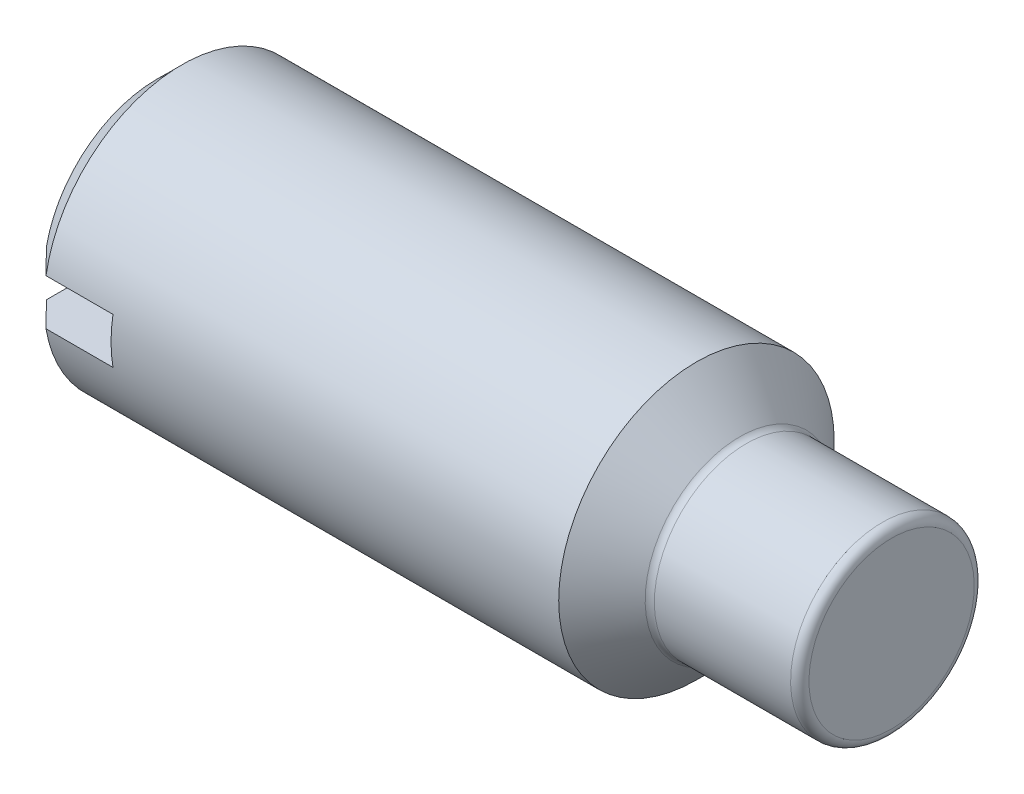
ISO-10303-21;
HEADER;
FILE_DESCRIPTION(('STEP AP214'),'2;1');
FILE_NAME('part.step','',(''),(''),'','','');
FILE_SCHEMA(('AUTOMOTIVE_DESIGN { 1 0 10303 214 1 1 1 1 }'));
ENDSEC;
DATA;
#1=APPLICATION_CONTEXT('core data for automotive mechanical design processes');
#2=APPLICATION_PROTOCOL_DEFINITION('international standard','automotive_design',2000,#1);
#3=PRODUCT_CONTEXT('',#1,'mechanical');
#4=PRODUCT('Part','Part','',(#3));
#5=PRODUCT_RELATED_PRODUCT_CATEGORY('part','',(#4));
#6=PRODUCT_DEFINITION_FORMATION('','',#4);
#7=PRODUCT_DEFINITION_CONTEXT('part definition',#1,'design');
#8=PRODUCT_DEFINITION('design','',#6,#7);
#9=PRODUCT_DEFINITION_SHAPE('','',#8);
#10=(LENGTH_UNIT() NAMED_UNIT(*) SI_UNIT(.MILLI.,.METRE.));
#11=(NAMED_UNIT(*) PLANE_ANGLE_UNIT() SI_UNIT($,.RADIAN.));
#12=(NAMED_UNIT(*) SI_UNIT($,.STERADIAN.) SOLID_ANGLE_UNIT());
#13=UNCERTAINTY_MEASURE_WITH_UNIT(LENGTH_MEASURE(1.E-05),#10,'distance_accuracy_value','');
#14=(GEOMETRIC_REPRESENTATION_CONTEXT(3) GLOBAL_UNCERTAINTY_ASSIGNED_CONTEXT((#13)) GLOBAL_UNIT_ASSIGNED_CONTEXT((#10,
#11,#12)) REPRESENTATION_CONTEXT('',''));
#15=CARTESIAN_POINT('',(0.,0.,0.));
#16=DIRECTION('',(0.,0.,1.));
#17=DIRECTION('',(1.,0.,0.));
#18=AXIS2_PLACEMENT_3D('',#15,#16,#17);
#19=CARTESIAN_POINT('',(0.,3.,0.));
#20=DIRECTION('',(1.,0.,0.));
#21=DIRECTION('',(0.,1.,0.));
#22=AXIS2_PLACEMENT_3D('',#19,#20,#21);
#23=PLANE('',#22);
#24=DIRECTION('',(0.,0.,1.));
#25=VECTOR('',#24,1.);
#26=CARTESIAN_POINT('',(0.,0.5,0.));
#27=LINE('',#26,#25);
#28=CARTESIAN_POINT('',(0.,0.5,-2.40711907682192));
#29=VERTEX_POINT('',#28);
#30=CARTESIAN_POINT('',(0.,0.5,2.40711907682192));
#31=VERTEX_POINT('',#30);
#32=EDGE_CURVE('E124',#29,#31,#27,.T.);
#33=ORIENTED_EDGE('',*,*,#32,.T.);
#34=CARTESIAN_POINT('',(0.,0.,0.));
#35=DIRECTION('',(1.,0.,0.));
#36=DIRECTION('',(0.,1.,0.));
#37=AXIS2_PLACEMENT_3D('',#34,#35,#36);
#38=CIRCLE('',#37,2.4585);
#39=EDGE_CURVE('E138',#31,#29,#38,.F.);
#40=ORIENTED_EDGE('',*,*,#39,.T.);
#41=EDGE_LOOP('',(#33,#40));
#42=FACE_BOUND('',#41,.T.);
#43=ADVANCED_FACE('F30',(#42),#23,.F.);
#44=CARTESIAN_POINT('',(16.,0.,0.));
#45=DIRECTION('',(-1.,0.,0.));
#46=DIRECTION('',(0.,-1.,0.));
#47=AXIS2_PLACEMENT_3D('',#44,#45,#46);
#48=PLANE('',#47);
#49=CARTESIAN_POINT('',(16.,0.,0.));
#50=DIRECTION('',(-1.,0.,0.));
#51=DIRECTION('',(0.,-1.,0.));
#52=AXIS2_PLACEMENT_3D('',#49,#50,#51);
#53=CIRCLE('',#52,1.8);
#54=CARTESIAN_POINT('',(16.,-1.8,0.));
#55=VERTEX_POINT('',#54);
#56=EDGE_CURVE('E132',#55,#55,#53,.F.);
#57=ORIENTED_EDGE('',*,*,#56,.T.);
#58=EDGE_LOOP('',(#57));
#59=FACE_BOUND('',#58,.T.);
#60=ADVANCED_FACE('F184',(#59),#48,.F.);
#61=CARTESIAN_POINT('',(-8.57033571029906,0.,0.));
#62=DIRECTION('',(-1.,0.,0.));
#63=DIRECTION('',(0.,-1.,0.));
#64=AXIS2_PLACEMENT_3D('',#61,#62,#63);
#65=CYLINDRICAL_SURFACE('',#64,2.);
#66=CARTESIAN_POINT('',(15.8,0.,0.));
#67=DIRECTION('',(-1.,0.,0.));
#68=DIRECTION('',(0.,-1.,0.));
#69=AXIS2_PLACEMENT_3D('',#66,#67,#68);
#70=CIRCLE('',#69,2.);
#71=CARTESIAN_POINT('',(15.8,-2.,0.));
#72=VERTEX_POINT('',#71);
#73=EDGE_CURVE('E129',#72,#72,#70,.T.);
#74=ORIENTED_EDGE('',*,*,#73,.T.);
#75=EDGE_LOOP('',(#74));
#76=FACE_BOUND('',#75,.T.);
#77=CARTESIAN_POINT('',(12.8328427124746,0.,0.));
#78=DIRECTION('',(-1.,0.,0.));
#79=DIRECTION('',(0.,-1.,0.));
#80=AXIS2_PLACEMENT_3D('',#77,#78,#79);
#81=CIRCLE('',#80,2.);
#82=CARTESIAN_POINT('',(12.8328427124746,-2.,0.));
#83=VERTEX_POINT('',#82);
#84=EDGE_CURVE('E107',#83,#83,#81,.F.);
#85=ORIENTED_EDGE('',*,*,#84,.T.);
#86=EDGE_LOOP('',(#85));
#87=FACE_BOUND('',#86,.T.);
#88=ADVANCED_FACE('F188',(#76,#87),#65,.T.);
#89=CARTESIAN_POINT('',(12.75,0.,0.));
#90=DIRECTION('',(-1.,0.,0.));
#91=DIRECTION('',(0.,-1.,0.));
#92=AXIS2_PLACEMENT_3D('',#89,#90,#91);
#93=CONICAL_SURFACE('',#92,2.,0.78539816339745);
#94=CARTESIAN_POINT('',(12.6914213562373,0.,0.));
#95=DIRECTION('',(-1.,0.,0.));
#96=DIRECTION('',(0.,-1.,0.));
#97=AXIS2_PLACEMENT_3D('',#94,#95,#96);
#98=CIRCLE('',#97,2.05857864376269);
#99=CARTESIAN_POINT('',(12.6914213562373,-2.05857864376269,0.));
#100=VERTEX_POINT('',#99);
#101=EDGE_CURVE('E135',#100,#100,#98,.T.);
#102=ORIENTED_EDGE('',*,*,#101,.T.);
#103=EDGE_LOOP('',(#102));
#104=FACE_BOUND('',#103,.T.);
#105=CARTESIAN_POINT('',(11.75,0.,0.));
#106=DIRECTION('',(-1.,0.,0.));
#107=DIRECTION('',(0.,-1.,0.));
#108=AXIS2_PLACEMENT_3D('',#105,#106,#107);
#109=CIRCLE('',#108,3.);
#110=CARTESIAN_POINT('',(11.75,-3.,0.));
#111=VERTEX_POINT('',#110);
#112=EDGE_CURVE('E119',#111,#111,#109,.T.);
#113=ORIENTED_EDGE('',*,*,#112,.F.);
#114=EDGE_LOOP('',(#113));
#115=FACE_BOUND('',#114,.T.);
#116=ADVANCED_FACE('F196',(#104,#115),#93,.T.);
#117=CARTESIAN_POINT('',(-8.57033571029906,0.,0.));
#118=DIRECTION('',(-1.,0.,0.));
#119=DIRECTION('',(0.,-1.,0.));
#120=AXIS2_PLACEMENT_3D('',#117,#118,#119);
#121=CYLINDRICAL_SURFACE('',#120,3.);
#122=DIRECTION('',(-1.,0.,0.));
#123=VECTOR('',#122,1.);
#124=CARTESIAN_POINT('',(-8.57033571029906,0.5,-2.95803989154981));
#125=LINE('',#124,#123);
#126=CARTESIAN_POINT('',(2.,0.5,-2.95803989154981));
#127=VERTEX_POINT('',#126);
#128=CARTESIAN_POINT('',(0.541499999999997,0.5,-2.95803989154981));
#129=VERTEX_POINT('',#128);
#130=EDGE_CURVE('E117',#127,#129,#125,.T.);
#131=ORIENTED_EDGE('',*,*,#130,.T.);
#132=CARTESIAN_POINT('',(0.541499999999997,0.,0.));
#133=DIRECTION('',(1.,0.,0.));
#134=DIRECTION('',(0.,1.,0.));
#135=AXIS2_PLACEMENT_3D('',#132,#133,#134);
#136=CIRCLE('',#135,3.);
#137=CARTESIAN_POINT('',(0.541499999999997,0.5,2.95803989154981));
#138=VERTEX_POINT('',#137);
#139=EDGE_CURVE('E175',#129,#138,#136,.T.);
#140=ORIENTED_EDGE('',*,*,#139,.T.);
#141=DIRECTION('',(-1.,0.,0.));
#142=VECTOR('',#141,1.);
#143=CARTESIAN_POINT('',(-8.57033571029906,0.5,2.95803989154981));
#144=LINE('',#143,#142);
#145=CARTESIAN_POINT('',(2.,0.5,2.95803989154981));
#146=VERTEX_POINT('',#145);
#147=EDGE_CURVE('E115',#138,#146,#144,.F.);
#148=ORIENTED_EDGE('',*,*,#147,.T.);
#149=CARTESIAN_POINT('',(2.,0.,0.));
#150=DIRECTION('',(1.,0.,0.));
#151=DIRECTION('',(0.,0.,-1.));
#152=AXIS2_PLACEMENT_3D('',#149,#150,#151);
#153=CIRCLE('',#152,3.);
#154=CARTESIAN_POINT('',(2.,-0.5,2.95803989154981));
#155=VERTEX_POINT('',#154);
#156=EDGE_CURVE('E108',#146,#155,#153,.T.);
#157=ORIENTED_EDGE('',*,*,#156,.T.);
#158=DIRECTION('',(-1.,0.,0.));
#159=VECTOR('',#158,1.);
#160=CARTESIAN_POINT('',(-8.57033571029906,-0.5,2.95803989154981));
#161=LINE('',#160,#159);
#162=CARTESIAN_POINT('',(0.541499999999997,-0.5,2.95803989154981));
#163=VERTEX_POINT('',#162);
#164=EDGE_CURVE('E96',#155,#163,#161,.T.);
#165=ORIENTED_EDGE('',*,*,#164,.T.);
#166=CARTESIAN_POINT('',(0.541499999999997,0.,0.));
#167=DIRECTION('',(1.,0.,0.));
#168=DIRECTION('',(0.,1.,0.));
#169=AXIS2_PLACEMENT_3D('',#166,#167,#168);
#170=CIRCLE('',#169,3.);
#171=CARTESIAN_POINT('',(0.541499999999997,-0.5,-2.95803989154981));
#172=VERTEX_POINT('',#171);
#173=EDGE_CURVE('E94',#163,#172,#170,.T.);
#174=ORIENTED_EDGE('',*,*,#173,.T.);
#175=DIRECTION('',(-1.,0.,0.));
#176=VECTOR('',#175,1.);
#177=CARTESIAN_POINT('',(-8.57033571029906,-0.5,-2.95803989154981));
#178=LINE('',#177,#176);
#179=CARTESIAN_POINT('',(2.,-0.5,-2.95803989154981));
#180=VERTEX_POINT('',#179);
#181=EDGE_CURVE('E86',#172,#180,#178,.F.);
#182=ORIENTED_EDGE('',*,*,#181,.T.);
#183=EDGE_CURVE('E91',#180,#127,#153,.T.);
#184=ORIENTED_EDGE('',*,*,#183,.T.);
#185=EDGE_LOOP('',(#131,#140,#148,#157,#165,#174,#182,#184));
#186=FACE_BOUND('',#185,.T.);
#187=ORIENTED_EDGE('',*,*,#112,.T.);
#188=EDGE_LOOP('',(#187));
#189=FACE_BOUND('',#188,.T.);
#190=ADVANCED_FACE('F89',(#186,#189),#121,.T.);
#191=DIRECTION('',(0.,0.,-1.));
#192=VECTOR('',#191,1.);
#193=CARTESIAN_POINT('',(0.,-0.5,0.));
#194=LINE('',#193,#192);
#195=CARTESIAN_POINT('',(0.,-0.5,2.40711907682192));
#196=VERTEX_POINT('',#195);
#197=CARTESIAN_POINT('',(0.,-0.5,-2.40711907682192));
#198=VERTEX_POINT('',#197);
#199=EDGE_CURVE('E122',#196,#198,#194,.T.);
#200=ORIENTED_EDGE('',*,*,#199,.T.);
#201=CARTESIAN_POINT('',(0.,0.,0.));
#202=DIRECTION('',(1.,0.,0.));
#203=DIRECTION('',(0.,1.,0.));
#204=AXIS2_PLACEMENT_3D('',#201,#202,#203);
#205=CIRCLE('',#204,2.4585);
#206=EDGE_CURVE('E173',#198,#196,#205,.F.);
#207=ORIENTED_EDGE('',*,*,#206,.T.);
#208=EDGE_LOOP('',(#200,#207));
#209=FACE_BOUND('',#208,.T.);
#210=ADVANCED_FACE('F162',(#209),#23,.F.);
#211=CARTESIAN_POINT('',(2.,0.5,-3.));
#212=DIRECTION('',(1.,0.,0.));
#213=DIRECTION('',(0.,0.,-1.));
#214=AXIS2_PLACEMENT_3D('',#211,#212,#213);
#215=PLANE('',#214);
#216=DIRECTION('',(0.,0.,1.));
#217=VECTOR('',#216,1.);
#218=CARTESIAN_POINT('',(2.,0.5,-3.));
#219=LINE('',#218,#217);
#220=EDGE_CURVE('E97',#127,#146,#219,.T.);
#221=ORIENTED_EDGE('',*,*,#220,.F.);
#222=ORIENTED_EDGE('',*,*,#183,.F.);
#223=DIRECTION('',(0.,0.,1.));
#224=VECTOR('',#223,1.);
#225=CARTESIAN_POINT('',(2.,-0.5,-3.));
#226=LINE('',#225,#224);
#227=EDGE_CURVE('E104',#180,#155,#226,.T.);
#228=ORIENTED_EDGE('',*,*,#227,.T.);
#229=ORIENTED_EDGE('',*,*,#156,.F.);
#230=EDGE_LOOP('',(#221,#222,#228,#229));
#231=FACE_BOUND('',#230,.T.);
#232=ADVANCED_FACE('F102',(#231),#215,.F.);
#233=CARTESIAN_POINT('',(0.,0.5,-3.));
#234=DIRECTION('',(0.,1.,0.));
#235=DIRECTION('',(0.,0.,1.));
#236=AXIS2_PLACEMENT_3D('',#233,#234,#235);
#237=PLANE('',#236);
#238=ORIENTED_EDGE('',*,*,#32,.F.);
#239=CARTESIAN_POINT('',(0.,0.5,-2.40711907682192));
#240=CARTESIAN_POINT('',(0.0900901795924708,0.5,-2.49909631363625));
#241=CARTESIAN_POINT('',(0.180260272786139,0.5,-2.59099500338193));
#242=CARTESIAN_POINT('',(0.360760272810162,0.5,-2.77463527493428));
#243=CARTESIAN_POINT('',(0.451090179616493,0.5,-2.86637685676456));
#244=CARTESIAN_POINT('',(0.541499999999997,0.5,-2.95803989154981));
#245=B_SPLINE_CURVE_WITH_KNOTS('',3,(#239,#240,#241,#242,#243,#244),.UNSPECIFIED.,.F.,.F.,(4,2,
4),(0.,0.386243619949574,0.772487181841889),.UNSPECIFIED.);
#246=EDGE_CURVE('E147',#29,#129,#245,.T.);
#247=ORIENTED_EDGE('',*,*,#246,.T.);
#248=ORIENTED_EDGE('',*,*,#130,.F.);
#249=ORIENTED_EDGE('',*,*,#220,.T.);
#250=ORIENTED_EDGE('',*,*,#147,.F.);
#251=CARTESIAN_POINT('',(0.541499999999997,0.5,2.95803989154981));
#252=CARTESIAN_POINT('',(0.451090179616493,0.5,2.86637685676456));
#253=CARTESIAN_POINT('',(0.360760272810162,0.5,2.77463527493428));
#254=CARTESIAN_POINT('',(0.180260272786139,0.5,2.59099500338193));
#255=CARTESIAN_POINT('',(0.0900901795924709,0.5,2.49909631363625));
#256=CARTESIAN_POINT('',(0.,0.5,2.40711907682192));
#257=B_SPLINE_CURVE_WITH_KNOTS('',3,(#251,#252,#253,#254,#255,#256),.UNSPECIFIED.,.F.,.F.,(4,2,
4),(0.,0.386243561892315,0.772487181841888),.UNSPECIFIED.);
#258=EDGE_CURVE('E141',#138,#31,#257,.T.);
#259=ORIENTED_EDGE('',*,*,#258,.T.);
#260=EDGE_LOOP('',(#238,#247,#248,#249,#250,#259));
#261=FACE_BOUND('',#260,.T.);
#262=ADVANCED_FACE('F155',(#261),#237,.F.);
#263=CARTESIAN_POINT('',(0.,-0.5,-3.));
#264=DIRECTION('',(0.,-1.,0.));
#265=DIRECTION('',(0.,0.,-1.));
#266=AXIS2_PLACEMENT_3D('',#263,#264,#265);
#267=PLANE('',#266);
#268=ORIENTED_EDGE('',*,*,#199,.F.);
#269=CARTESIAN_POINT('',(0.,-0.5,2.40711907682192));
#270=CARTESIAN_POINT('',(0.0900901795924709,-0.5,2.49909631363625));
#271=CARTESIAN_POINT('',(0.180260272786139,-0.5,2.59099500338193));
#272=CARTESIAN_POINT('',(0.360760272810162,-0.5,2.77463527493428));
#273=CARTESIAN_POINT('',(0.451090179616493,-0.5,2.86637685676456));
#274=CARTESIAN_POINT('',(0.541499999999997,-0.5,2.95803989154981));
#275=B_SPLINE_CURVE_WITH_KNOTS('',3,(#269,#270,#271,#272,#273,#274),.UNSPECIFIED.,.F.,.F.,(4,2,
4),(0.,0.386243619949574,0.772487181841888),.UNSPECIFIED.);
#276=EDGE_CURVE('E11',#196,#163,#275,.T.);
#277=ORIENTED_EDGE('',*,*,#276,.T.);
#278=ORIENTED_EDGE('',*,*,#164,.F.);
#279=ORIENTED_EDGE('',*,*,#227,.F.);
#280=ORIENTED_EDGE('',*,*,#181,.F.);
#281=CARTESIAN_POINT('',(0.541499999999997,-0.5,-2.95803989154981));
#282=CARTESIAN_POINT('',(0.451090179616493,-0.5,-2.86637685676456));
#283=CARTESIAN_POINT('',(0.360760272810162,-0.5,-2.77463527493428));
#284=CARTESIAN_POINT('',(0.180260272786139,-0.5,-2.59099500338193));
#285=CARTESIAN_POINT('',(0.0900901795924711,-0.5,-2.49909631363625));
#286=CARTESIAN_POINT('',(0.,-0.5,-2.40711907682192));
#287=B_SPLINE_CURVE_WITH_KNOTS('',3,(#281,#282,#283,#284,#285,#286),.UNSPECIFIED.,.F.,.F.,(4,2,
4),(0.,0.386243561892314,0.772487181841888),.UNSPECIFIED.);
#288=EDGE_CURVE('E43',#172,#198,#287,.T.);
#289=ORIENTED_EDGE('',*,*,#288,.T.);
#290=EDGE_LOOP('',(#268,#277,#278,#279,#280,#289));
#291=FACE_BOUND('',#290,.T.);
#292=ADVANCED_FACE('F110',(#291),#267,.F.);
#293=CARTESIAN_POINT('',(15.8,0.,0.));
#294=DIRECTION('',(-1.,0.,0.));
#295=DIRECTION('',(0.,-1.,0.));
#296=AXIS2_PLACEMENT_3D('',#293,#294,#295);
#297=TOROIDAL_SURFACE('',#296,1.8,0.2);
#298=ORIENTED_EDGE('',*,*,#56,.F.);
#299=EDGE_LOOP('',(#298));
#300=FACE_BOUND('',#299,.T.);
#301=ORIENTED_EDGE('',*,*,#73,.F.);
#302=EDGE_LOOP('',(#301));
#303=FACE_BOUND('',#302,.T.);
#304=ADVANCED_FACE('F166',(#300,#303),#297,.T.);
#305=CARTESIAN_POINT('',(12.8328427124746,0.,0.));
#306=DIRECTION('',(-1.,0.,0.));
#307=DIRECTION('',(0.,-1.,0.));
#308=AXIS2_PLACEMENT_3D('',#305,#306,#307);
#309=TOROIDAL_SURFACE('',#308,2.2,0.2);
#310=ORIENTED_EDGE('',*,*,#84,.F.);
#311=EDGE_LOOP('',(#310));
#312=FACE_BOUND('',#311,.T.);
#313=ORIENTED_EDGE('',*,*,#101,.F.);
#314=EDGE_LOOP('',(#313));
#315=FACE_BOUND('',#314,.T.);
#316=ADVANCED_FACE('F201',(#312,#315),#309,.F.);
#317=CARTESIAN_POINT('',(0.,0.,0.));
#318=DIRECTION('',(1.,0.,0.));
#319=DIRECTION('',(0.,1.,0.));
#320=AXIS2_PLACEMENT_3D('',#317,#318,#319);
#321=CONICAL_SURFACE('',#320,2.4585,0.785398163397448);
#322=ORIENTED_EDGE('',*,*,#258,.F.);
#323=ORIENTED_EDGE('',*,*,#139,.F.);
#324=ORIENTED_EDGE('',*,*,#246,.F.);
#325=ORIENTED_EDGE('',*,*,#39,.F.);
#326=EDGE_LOOP('',(#322,#323,#324,#325));
#327=FACE_BOUND('',#326,.T.);
#328=ADVANCED_FACE('F152',(#327),#321,.T.);
#329=CARTESIAN_POINT('',(0.,0.,0.));
#330=DIRECTION('',(1.,0.,0.));
#331=DIRECTION('',(0.,1.,0.));
#332=AXIS2_PLACEMENT_3D('',#329,#330,#331);
#333=CONICAL_SURFACE('',#332,2.4585,0.785398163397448);
#334=ORIENTED_EDGE('',*,*,#288,.F.);
#335=ORIENTED_EDGE('',*,*,#173,.F.);
#336=ORIENTED_EDGE('',*,*,#276,.F.);
#337=ORIENTED_EDGE('',*,*,#206,.F.);
#338=EDGE_LOOP('',(#334,#335,#336,#337));
#339=FACE_BOUND('',#338,.T.);
#340=ADVANCED_FACE('F32',(#339),#333,.T.);
#341=CLOSED_SHELL('',(#43,#60,#88,#116,#190,#210,#232,#262,#292,#304,#316,#328,#340));
#342=MANIFOLD_SOLID_BREP('B2',#341);
#343=ADVANCED_BREP_SHAPE_REPRESENTATION('',(#18,#342),#14);
#344=SHAPE_DEFINITION_REPRESENTATION(#9,#343);
ENDSEC;
END-ISO-10303-21;
